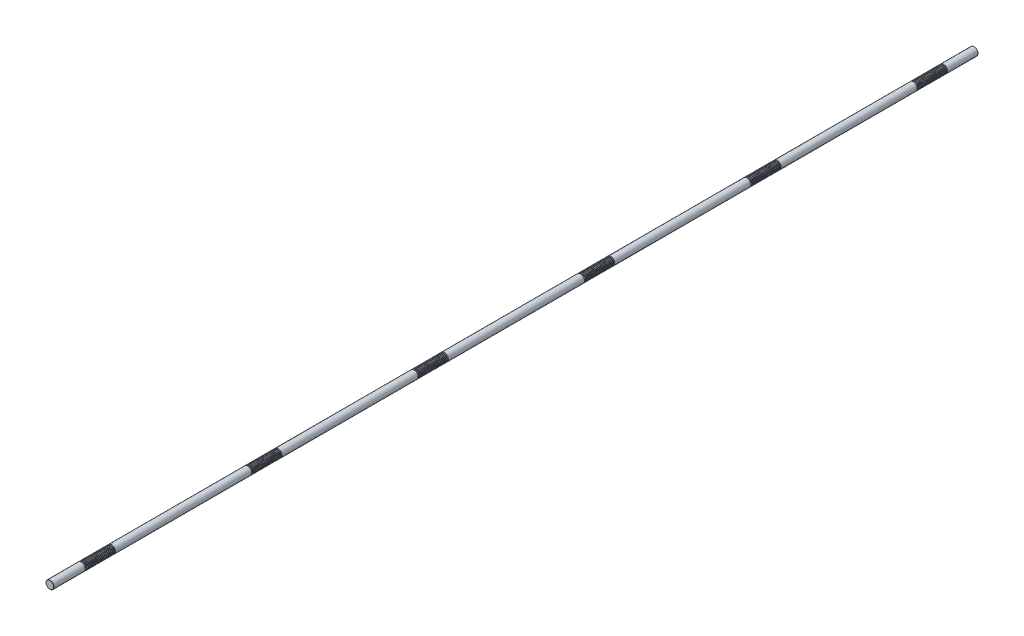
from build123d import *

# Parameters (mm, degrees)
SKETCH1_R           = 13
BOSS_EXTRUDE1_DEPTH = 1500
CHAMFER1_SIZE       = 0.65
LPATTERN1_COUNT     = 20
LPATTERN1_PITCH     = 5
LPATTERN2_COUNT     = 6
LPATTERN2_PITCH     = 540


with BuildPart() as part:
    # Sketch1 → Boss-Extrude1 (new, symmetric)
    with BuildSketch(Plane.XY):
        Circle(SKETCH1_R)
    extrude(amount=BOSS_EXTRUDE1_DEPTH, both=True)

    # Chamfer1
    chamfer1_edges = [part.edges().sort_by_distance(p)[0] for p in [
        (-13, 0, -1500),
        (-13, 0, 1500),
    ]]
    chamfer(chamfer1_edges, length=CHAMFER1_SIZE)

    # Sketch2 → Cut-Revolve1 (revolve, cut)
    with BuildSketch(Plane(origin=(0, 0, 0), x_dir=(0, 0, -1), z_dir=(1, 0, 0)), mode=Mode.PRIVATE) as cut_revolve1_sk:
        Polygon((1400.36843014, 13), (1397.13156986, 13), (1397.86843014, 10.25), (1399.63156986, 10.25), align=None)
    cut_revolve1 = revolve(cut_revolve1_sk.sketch.rotate(Axis((0, 0, 1500), (0, 0, -1)), 90), axis=Axis((0, 0, 1500), (0, 0, -1)), mode=Mode.SUBTRACT)

    # LPattern1: Cut-Revolve1 ×20
    with Locations(*[(0, 0, i * LPATTERN1_PITCH) for i in range(1, LPATTERN1_COUNT)]):
        add(cut_revolve1, mode=Mode.SUBTRACT)

    # LPattern2: Cut-Revolve1 ×6
    with Locations(*[(0, 0, i * LPATTERN2_PITCH) for i in range(1, LPATTERN2_COUNT)]):
        add(cut_revolve1, mode=Mode.SUBTRACT)

    # LPattern2 copy 1 sketch → LPattern2 copy 1 (revolve, cut)
    with BuildSketch(Plane(origin=(0, 0, 545), x_dir=(0, 0, -1), z_dir=(1, 0, 0))):
        Polygon((1400.36843014, 13), (1397.13156986, 13), (1397.86843014, 10.25), (1399.63156986, 10.25), align=None)
    revolve(axis=Axis((0, 0, 2045), (0, 0, -1)), mode=Mode.SUBTRACT)

    # LPattern2 copy 2 sketch → LPattern2 copy 2 (revolve, cut)
    with BuildSketch(Plane(origin=(0, 0, 1085), x_dir=(0, 0, -1), z_dir=(1, 0, 0))):
        Polygon((1400.36843014, 13), (1397.13156986, 13), (1397.86843014, 10.25), (1399.63156986, 10.25), align=None)
    revolve(axis=Axis((0, 0, 2585), (0, 0, -1)), mode=Mode.SUBTRACT)

    # LPattern2 copy 3 sketch → LPattern2 copy 3 (revolve, cut)
    with BuildSketch(Plane(origin=(0, 0, 1625), x_dir=(0, 0, -1), z_dir=(1, 0, 0))):
        Polygon((1400.36843014, 13), (1397.13156986, 13), (1397.86843014, 10.25), (1399.63156986, 10.25), align=None)
    revolve(axis=Axis((0, 0, 3125), (0, 0, -1)), mode=Mode.SUBTRACT)

    # LPattern2 copy 4 sketch → LPattern2 copy 4 (revolve, cut)
    with BuildSketch(Plane(origin=(0, 0, 2165), x_dir=(0, 0, -1), z_dir=(1, 0, 0))):
        Polygon((1400.36843014, 13), (1397.13156986, 13), (1397.86843014, 10.25), (1399.63156986, 10.25), align=None)
    revolve(axis=Axis((0, 0, 3665), (0, 0, -1)), mode=Mode.SUBTRACT)

    # LPattern2 copy 5 sketch → LPattern2 copy 5 (revolve, cut)
    with BuildSketch(Plane(origin=(0, 0, 2705), x_dir=(0, 0, -1), z_dir=(1, 0, 0))):
        Polygon((1400.36843014, 13), (1397.13156986, 13), (1397.86843014, 10.25), (1399.63156986, 10.25), align=None)
    revolve(axis=Axis((0, 0, 4205), (0, 0, -1)), mode=Mode.SUBTRACT)

    # LPattern2 copy 6 sketch → LPattern2 copy 6 (revolve, cut)
    with BuildSketch(Plane(origin=(0, 0, 550), x_dir=(0, 0, -1), z_dir=(1, 0, 0))):
        Polygon((1400.36843014, 13), (1397.13156986, 13), (1397.86843014, 10.25), (1399.63156986, 10.25), align=None)
    revolve(axis=Axis((0, 0, 2050), (0, 0, -1)), mode=Mode.SUBTRACT)

    # LPattern2 copy 7 sketch → LPattern2 copy 7 (revolve, cut)
    with BuildSketch(Plane(origin=(0, 0, 1090), x_dir=(0, 0, -1), z_dir=(1, 0, 0))):
        Polygon((1400.36843014, 13), (1397.13156986, 13), (1397.86843014, 10.25), (1399.63156986, 10.25), align=None)
    revolve(axis=Axis((0, 0, 2590), (0, 0, -1)), mode=Mode.SUBTRACT)

    # LPattern2 copy 8 sketch → LPattern2 copy 8 (revolve, cut)
    with BuildSketch(Plane(origin=(0, 0, 1630), x_dir=(0, 0, -1), z_dir=(1, 0, 0))):
        Polygon((1400.36843014, 13), (1397.13156986, 13), (1397.86843014, 10.25), (1399.63156986, 10.25), align=None)
    revolve(axis=Axis((0, 0, 3130), (0, 0, -1)), mode=Mode.SUBTRACT)

    # LPattern2 copy 9 sketch → LPattern2 copy 9 (revolve, cut)
    with BuildSketch(Plane(origin=(0, 0, 2170), x_dir=(0, 0, -1), z_dir=(1, 0, 0))):
        Polygon((1400.36843014, 13), (1397.13156986, 13), (1397.86843014, 10.25), (1399.63156986, 10.25), align=None)
    revolve(axis=Axis((0, 0, 3670), (0, 0, -1)), mode=Mode.SUBTRACT)

    # LPattern2 copy 10 sketch → LPattern2 copy 10 (revolve, cut)
    with BuildSketch(Plane(origin=(0, 0, 2710), x_dir=(0, 0, -1), z_dir=(1, 0, 0))):
        Polygon((1400.36843014, 13), (1397.13156986, 13), (1397.86843014, 10.25), (1399.63156986, 10.25), align=None)
    revolve(axis=Axis((0, 0, 4210), (0, 0, -1)), mode=Mode.SUBTRACT)

    # LPattern2 copy 11 sketch → LPattern2 copy 11 (revolve, cut)
    with BuildSketch(Plane(origin=(0, 0, 555), x_dir=(0, 0, -1), z_dir=(1, 0, 0))):
        Polygon((1400.36843014, 13), (1397.13156986, 13), (1397.86843014, 10.25), (1399.63156986, 10.25), align=None)
    revolve(axis=Axis((0, 0, 2055), (0, 0, -1)), mode=Mode.SUBTRACT)

    # LPattern2 copy 12 sketch → LPattern2 copy 12 (revolve, cut)
    with BuildSketch(Plane(origin=(0, 0, 1095), x_dir=(0, 0, -1), z_dir=(1, 0, 0))):
        Polygon((1400.36843014, 13), (1397.13156986, 13), (1397.86843014, 10.25), (1399.63156986, 10.25), align=None)
    revolve(axis=Axis((0, 0, 2595), (0, 0, -1)), mode=Mode.SUBTRACT)

    # LPattern2 copy 13 sketch → LPattern2 copy 13 (revolve, cut)
    with BuildSketch(Plane(origin=(0, 0, 1635), x_dir=(0, 0, -1), z_dir=(1, 0, 0))):
        Polygon((1400.36843014, 13), (1397.13156986, 13), (1397.86843014, 10.25), (1399.63156986, 10.25), align=None)
    revolve(axis=Axis((0, 0, 3135), (0, 0, -1)), mode=Mode.SUBTRACT)

    # LPattern2 copy 14 sketch → LPattern2 copy 14 (revolve, cut)
    with BuildSketch(Plane(origin=(0, 0, 2175), x_dir=(0, 0, -1), z_dir=(1, 0, 0))):
        Polygon((1400.36843014, 13), (1397.13156986, 13), (1397.86843014, 10.25), (1399.63156986, 10.25), align=None)
    revolve(axis=Axis((0, 0, 3675), (0, 0, -1)), mode=Mode.SUBTRACT)

    # LPattern2 copy 15 sketch → LPattern2 copy 15 (revolve, cut)
    with BuildSketch(Plane(origin=(0, 0, 2715), x_dir=(0, 0, -1), z_dir=(1, 0, 0))):
        Polygon((1400.36843014, 13), (1397.13156986, 13), (1397.86843014, 10.25), (1399.63156986, 10.25), align=None)
    revolve(axis=Axis((0, 0, 4215), (0, 0, -1)), mode=Mode.SUBTRACT)

    # LPattern2 copy 16 sketch → LPattern2 copy 16 (revolve, cut)
    with BuildSketch(Plane(origin=(0, 0, 560), x_dir=(0, 0, -1), z_dir=(1, 0, 0))):
        Polygon((1400.36843014, 13), (1397.13156986, 13), (1397.86843014, 10.25), (1399.63156986, 10.25), align=None)
    revolve(axis=Axis((0, 0, 2060), (0, 0, -1)), mode=Mode.SUBTRACT)

    # LPattern2 copy 17 sketch → LPattern2 copy 17 (revolve, cut)
    with BuildSketch(Plane(origin=(0, 0, 1100), x_dir=(0, 0, -1), z_dir=(1, 0, 0))):
        Polygon((1400.36843014, 13), (1397.13156986, 13), (1397.86843014, 10.25), (1399.63156986, 10.25), align=None)
    revolve(axis=Axis((0, 0, 2600), (0, 0, -1)), mode=Mode.SUBTRACT)

    # LPattern2 copy 18 sketch → LPattern2 copy 18 (revolve, cut)
    with BuildSketch(Plane(origin=(0, 0, 1640), x_dir=(0, 0, -1), z_dir=(1, 0, 0))):
        Polygon((1400.36843014, 13), (1397.13156986, 13), (1397.86843014, 10.25), (1399.63156986, 10.25), align=None)
    revolve(axis=Axis((0, 0, 3140), (0, 0, -1)), mode=Mode.SUBTRACT)

    # LPattern2 copy 19 sketch → LPattern2 copy 19 (revolve, cut)
    with BuildSketch(Plane(origin=(0, 0, 2180), x_dir=(0, 0, -1), z_dir=(1, 0, 0))):
        Polygon((1400.36843014, 13), (1397.13156986, 13), (1397.86843014, 10.25), (1399.63156986, 10.25), align=None)
    revolve(axis=Axis((0, 0, 3680), (0, 0, -1)), mode=Mode.SUBTRACT)

    # LPattern2 copy 20 sketch → LPattern2 copy 20 (revolve, cut)
    with BuildSketch(Plane(origin=(0, 0, 2720), x_dir=(0, 0, -1), z_dir=(1, 0, 0))):
        Polygon((1400.36843014, 13), (1397.13156986, 13), (1397.86843014, 10.25), (1399.63156986, 10.25), align=None)
    revolve(axis=Axis((0, 0, 4220), (0, 0, -1)), mode=Mode.SUBTRACT)

    # LPattern2 copy 21 sketch → LPattern2 copy 21 (revolve, cut)
    with BuildSketch(Plane(origin=(0, 0, 565), x_dir=(0, 0, -1), z_dir=(1, 0, 0))):
        Polygon((1400.36843014, 13), (1397.13156986, 13), (1397.86843014, 10.25), (1399.63156986, 10.25), align=None)
    revolve(axis=Axis((0, 0, 2065), (0, 0, -1)), mode=Mode.SUBTRACT)

    # LPattern2 copy 22 sketch → LPattern2 copy 22 (revolve, cut)
    with BuildSketch(Plane(origin=(0, 0, 1105), x_dir=(0, 0, -1), z_dir=(1, 0, 0))):
        Polygon((1400.36843014, 13), (1397.13156986, 13), (1397.86843014, 10.25), (1399.63156986, 10.25), align=None)
    revolve(axis=Axis((0, 0, 2605), (0, 0, -1)), mode=Mode.SUBTRACT)

    # LPattern2 copy 23 sketch → LPattern2 copy 23 (revolve, cut)
    with BuildSketch(Plane(origin=(0, 0, 1645), x_dir=(0, 0, -1), z_dir=(1, 0, 0))):
        Polygon((1400.36843014, 13), (1397.13156986, 13), (1397.86843014, 10.25), (1399.63156986, 10.25), align=None)
    revolve(axis=Axis((0, 0, 3145), (0, 0, -1)), mode=Mode.SUBTRACT)

    # LPattern2 copy 24 sketch → LPattern2 copy 24 (revolve, cut)
    with BuildSketch(Plane(origin=(0, 0, 2185), x_dir=(0, 0, -1), z_dir=(1, 0, 0))):
        Polygon((1400.36843014, 13), (1397.13156986, 13), (1397.86843014, 10.25), (1399.63156986, 10.25), align=None)
    revolve(axis=Axis((0, 0, 3685), (0, 0, -1)), mode=Mode.SUBTRACT)

    # LPattern2 copy 25 sketch → LPattern2 copy 25 (revolve, cut)
    with BuildSketch(Plane(origin=(0, 0, 2725), x_dir=(0, 0, -1), z_dir=(1, 0, 0))):
        Polygon((1400.36843014, 13), (1397.13156986, 13), (1397.86843014, 10.25), (1399.63156986, 10.25), align=None)
    revolve(axis=Axis((0, 0, 4225), (0, 0, -1)), mode=Mode.SUBTRACT)

    # LPattern2 copy 26 sketch → LPattern2 copy 26 (revolve, cut)
    with BuildSketch(Plane(origin=(0, 0, 570), x_dir=(0, 0, -1), z_dir=(1, 0, 0))):
        Polygon((1400.36843014, 13), (1397.13156986, 13), (1397.86843014, 10.25), (1399.63156986, 10.25), align=None)
    revolve(axis=Axis((0, 0, 2070), (0, 0, -1)), mode=Mode.SUBTRACT)

    # LPattern2 copy 27 sketch → LPattern2 copy 27 (revolve, cut)
    with BuildSketch(Plane(origin=(0, 0, 1110), x_dir=(0, 0, -1), z_dir=(1, 0, 0))):
        Polygon((1400.36843014, 13), (1397.13156986, 13), (1397.86843014, 10.25), (1399.63156986, 10.25), align=None)
    revolve(axis=Axis((0, 0, 2610), (0, 0, -1)), mode=Mode.SUBTRACT)

    # LPattern2 copy 28 sketch → LPattern2 copy 28 (revolve, cut)
    with BuildSketch(Plane(origin=(0, 0, 1650), x_dir=(0, 0, -1), z_dir=(1, 0, 0))):
        Polygon((1400.36843014, 13), (1397.13156986, 13), (1397.86843014, 10.25), (1399.63156986, 10.25), align=None)
    revolve(axis=Axis((0, 0, 3150), (0, 0, -1)), mode=Mode.SUBTRACT)

    # LPattern2 copy 29 sketch → LPattern2 copy 29 (revolve, cut)
    with BuildSketch(Plane(origin=(0, 0, 2190), x_dir=(0, 0, -1), z_dir=(1, 0, 0))):
        Polygon((1400.36843014, 13), (1397.13156986, 13), (1397.86843014, 10.25), (1399.63156986, 10.25), align=None)
    revolve(axis=Axis((0, 0, 3690), (0, 0, -1)), mode=Mode.SUBTRACT)

    # LPattern2 copy 30 sketch → LPattern2 copy 30 (revolve, cut)
    with BuildSketch(Plane(origin=(0, 0, 2730), x_dir=(0, 0, -1), z_dir=(1, 0, 0))):
        Polygon((1400.36843014, 13), (1397.13156986, 13), (1397.86843014, 10.25), (1399.63156986, 10.25), align=None)
    revolve(axis=Axis((0, 0, 4230), (0, 0, -1)), mode=Mode.SUBTRACT)

    # LPattern2 copy 31 sketch → LPattern2 copy 31 (revolve, cut)
    with BuildSketch(Plane(origin=(0, 0, 575), x_dir=(0, 0, -1), z_dir=(1, 0, 0))):
        Polygon((1400.36843014, 13), (1397.13156986, 13), (1397.86843014, 10.25), (1399.63156986, 10.25), align=None)
    revolve(axis=Axis((0, 0, 2075), (0, 0, -1)), mode=Mode.SUBTRACT)

    # LPattern2 copy 32 sketch → LPattern2 copy 32 (revolve, cut)
    with BuildSketch(Plane(origin=(0, 0, 1115), x_dir=(0, 0, -1), z_dir=(1, 0, 0))):
        Polygon((1400.36843014, 13), (1397.13156986, 13), (1397.86843014, 10.25), (1399.63156986, 10.25), align=None)
    revolve(axis=Axis((0, 0, 2615), (0, 0, -1)), mode=Mode.SUBTRACT)

    # LPattern2 copy 33 sketch → LPattern2 copy 33 (revolve, cut)
    with BuildSketch(Plane(origin=(0, 0, 1655), x_dir=(0, 0, -1), z_dir=(1, 0, 0))):
        Polygon((1400.36843014, 13), (1397.13156986, 13), (1397.86843014, 10.25), (1399.63156986, 10.25), align=None)
    revolve(axis=Axis((0, 0, 3155), (0, 0, -1)), mode=Mode.SUBTRACT)

    # LPattern2 copy 34 sketch → LPattern2 copy 34 (revolve, cut)
    with BuildSketch(Plane(origin=(0, 0, 2195), x_dir=(0, 0, -1), z_dir=(1, 0, 0))):
        Polygon((1400.36843014, 13), (1397.13156986, 13), (1397.86843014, 10.25), (1399.63156986, 10.25), align=None)
    revolve(axis=Axis((0, 0, 3695), (0, 0, -1)), mode=Mode.SUBTRACT)

    # LPattern2 copy 35 sketch → LPattern2 copy 35 (revolve, cut)
    with BuildSketch(Plane(origin=(0, 0, 2735), x_dir=(0, 0, -1), z_dir=(1, 0, 0))):
        Polygon((1400.36843014, 13), (1397.13156986, 13), (1397.86843014, 10.25), (1399.63156986, 10.25), align=None)
    revolve(axis=Axis((0, 0, 4235), (0, 0, -1)), mode=Mode.SUBTRACT)

    # LPattern2 copy 36 sketch → LPattern2 copy 36 (revolve, cut)
    with BuildSketch(Plane(origin=(0, 0, 580), x_dir=(0, 0, -1), z_dir=(1, 0, 0))):
        Polygon((1400.36843014, 13), (1397.13156986, 13), (1397.86843014, 10.25), (1399.63156986, 10.25), align=None)
    revolve(axis=Axis((0, 0, 2080), (0, 0, -1)), mode=Mode.SUBTRACT)

    # LPattern2 copy 37 sketch → LPattern2 copy 37 (revolve, cut)
    with BuildSketch(Plane(origin=(0, 0, 1120), x_dir=(0, 0, -1), z_dir=(1, 0, 0))):
        Polygon((1400.36843014, 13), (1397.13156986, 13), (1397.86843014, 10.25), (1399.63156986, 10.25), align=None)
    revolve(axis=Axis((0, 0, 2620), (0, 0, -1)), mode=Mode.SUBTRACT)

    # LPattern2 copy 38 sketch → LPattern2 copy 38 (revolve, cut)
    with BuildSketch(Plane(origin=(0, 0, 1660), x_dir=(0, 0, -1), z_dir=(1, 0, 0))):
        Polygon((1400.36843014, 13), (1397.13156986, 13), (1397.86843014, 10.25), (1399.63156986, 10.25), align=None)
    revolve(axis=Axis((0, 0, 3160), (0, 0, -1)), mode=Mode.SUBTRACT)

    # LPattern2 copy 39 sketch → LPattern2 copy 39 (revolve, cut)
    with BuildSketch(Plane(origin=(0, 0, 2200), x_dir=(0, 0, -1), z_dir=(1, 0, 0))):
        Polygon((1400.36843014, 13), (1397.13156986, 13), (1397.86843014, 10.25), (1399.63156986, 10.25), align=None)
    revolve(axis=Axis((0, 0, 3700), (0, 0, -1)), mode=Mode.SUBTRACT)

    # LPattern2 copy 40 sketch → LPattern2 copy 40 (revolve, cut)
    with BuildSketch(Plane(origin=(0, 0, 2740), x_dir=(0, 0, -1), z_dir=(1, 0, 0))):
        Polygon((1400.36843014, 13), (1397.13156986, 13), (1397.86843014, 10.25), (1399.63156986, 10.25), align=None)
    revolve(axis=Axis((0, 0, 4240), (0, 0, -1)), mode=Mode.SUBTRACT)

    # LPattern2 copy 41 sketch → LPattern2 copy 41 (revolve, cut)
    with BuildSketch(Plane(origin=(0, 0, 585), x_dir=(0, 0, -1), z_dir=(1, 0, 0))):
        Polygon((1400.36843014, 13), (1397.13156986, 13), (1397.86843014, 10.25), (1399.63156986, 10.25), align=None)
    revolve(axis=Axis((0, 0, 2085), (0, 0, -1)), mode=Mode.SUBTRACT)

    # LPattern2 copy 42 sketch → LPattern2 copy 42 (revolve, cut)
    with BuildSketch(Plane(origin=(0, 0, 1125), x_dir=(0, 0, -1), z_dir=(1, 0, 0))):
        Polygon((1400.36843014, 13), (1397.13156986, 13), (1397.86843014, 10.25), (1399.63156986, 10.25), align=None)
    revolve(axis=Axis((0, 0, 2625), (0, 0, -1)), mode=Mode.SUBTRACT)

    # LPattern2 copy 43 sketch → LPattern2 copy 43 (revolve, cut)
    with BuildSketch(Plane(origin=(0, 0, 1665), x_dir=(0, 0, -1), z_dir=(1, 0, 0))):
        Polygon((1400.36843014, 13), (1397.13156986, 13), (1397.86843014, 10.25), (1399.63156986, 10.25), align=None)
    revolve(axis=Axis((0, 0, 3165), (0, 0, -1)), mode=Mode.SUBTRACT)

    # LPattern2 copy 44 sketch → LPattern2 copy 44 (revolve, cut)
    with BuildSketch(Plane(origin=(0, 0, 2205), x_dir=(0, 0, -1), z_dir=(1, 0, 0))):
        Polygon((1400.36843014, 13), (1397.13156986, 13), (1397.86843014, 10.25), (1399.63156986, 10.25), align=None)
    revolve(axis=Axis((0, 0, 3705), (0, 0, -1)), mode=Mode.SUBTRACT)

    # LPattern2 copy 45 sketch → LPattern2 copy 45 (revolve, cut)
    with BuildSketch(Plane(origin=(0, 0, 2745), x_dir=(0, 0, -1), z_dir=(1, 0, 0))):
        Polygon((1400.36843014, 13), (1397.13156986, 13), (1397.86843014, 10.25), (1399.63156986, 10.25), align=None)
    revolve(axis=Axis((0, 0, 4245), (0, 0, -1)), mode=Mode.SUBTRACT)

    # LPattern2 copy 46 sketch → LPattern2 copy 46 (revolve, cut)
    with BuildSketch(Plane(origin=(0, 0, 590), x_dir=(0, 0, -1), z_dir=(1, 0, 0))):
        Polygon((1400.36843014, 13), (1397.13156986, 13), (1397.86843014, 10.25), (1399.63156986, 10.25), align=None)
    revolve(axis=Axis((0, 0, 2090), (0, 0, -1)), mode=Mode.SUBTRACT)

    # LPattern2 copy 47 sketch → LPattern2 copy 47 (revolve, cut)
    with BuildSketch(Plane(origin=(0, 0, 1130), x_dir=(0, 0, -1), z_dir=(1, 0, 0))):
        Polygon((1400.36843014, 13), (1397.13156986, 13), (1397.86843014, 10.25), (1399.63156986, 10.25), align=None)
    revolve(axis=Axis((0, 0, 2630), (0, 0, -1)), mode=Mode.SUBTRACT)

    # LPattern2 copy 48 sketch → LPattern2 copy 48 (revolve, cut)
    with BuildSketch(Plane(origin=(0, 0, 1670), x_dir=(0, 0, -1), z_dir=(1, 0, 0))):
        Polygon((1400.36843014, 13), (1397.13156986, 13), (1397.86843014, 10.25), (1399.63156986, 10.25), align=None)
    revolve(axis=Axis((0, 0, 3170), (0, 0, -1)), mode=Mode.SUBTRACT)

    # LPattern2 copy 49 sketch → LPattern2 copy 49 (revolve, cut)
    with BuildSketch(Plane(origin=(0, 0, 2210), x_dir=(0, 0, -1), z_dir=(1, 0, 0))):
        Polygon((1400.36843014, 13), (1397.13156986, 13), (1397.86843014, 10.25), (1399.63156986, 10.25), align=None)
    revolve(axis=Axis((0, 0, 3710), (0, 0, -1)), mode=Mode.SUBTRACT)

    # LPattern2 copy 50 sketch → LPattern2 copy 50 (revolve, cut)
    with BuildSketch(Plane(origin=(0, 0, 2750), x_dir=(0, 0, -1), z_dir=(1, 0, 0))):
        Polygon((1400.36843014, 13), (1397.13156986, 13), (1397.86843014, 10.25), (1399.63156986, 10.25), align=None)
    revolve(axis=Axis((0, 0, 4250), (0, 0, -1)), mode=Mode.SUBTRACT)

    # LPattern2 copy 51 sketch → LPattern2 copy 51 (revolve, cut)
    with BuildSketch(Plane(origin=(0, 0, 595), x_dir=(0, 0, -1), z_dir=(1, 0, 0))):
        Polygon((1400.36843014, 13), (1397.13156986, 13), (1397.86843014, 10.25), (1399.63156986, 10.25), align=None)
    revolve(axis=Axis((0, 0, 2095), (0, 0, -1)), mode=Mode.SUBTRACT)

    # LPattern2 copy 52 sketch → LPattern2 copy 52 (revolve, cut)
    with BuildSketch(Plane(origin=(0, 0, 1135), x_dir=(0, 0, -1), z_dir=(1, 0, 0))):
        Polygon((1400.36843014, 13), (1397.13156986, 13), (1397.86843014, 10.25), (1399.63156986, 10.25), align=None)
    revolve(axis=Axis((0, 0, 2635), (0, 0, -1)), mode=Mode.SUBTRACT)

    # LPattern2 copy 53 sketch → LPattern2 copy 53 (revolve, cut)
    with BuildSketch(Plane(origin=(0, 0, 1675), x_dir=(0, 0, -1), z_dir=(1, 0, 0))):
        Polygon((1400.36843014, 13), (1397.13156986, 13), (1397.86843014, 10.25), (1399.63156986, 10.25), align=None)
    revolve(axis=Axis((0, 0, 3175), (0, 0, -1)), mode=Mode.SUBTRACT)

    # LPattern2 copy 54 sketch → LPattern2 copy 54 (revolve, cut)
    with BuildSketch(Plane(origin=(0, 0, 2215), x_dir=(0, 0, -1), z_dir=(1, 0, 0))):
        Polygon((1400.36843014, 13), (1397.13156986, 13), (1397.86843014, 10.25), (1399.63156986, 10.25), align=None)
    revolve(axis=Axis((0, 0, 3715), (0, 0, -1)), mode=Mode.SUBTRACT)

    # LPattern2 copy 55 sketch → LPattern2 copy 55 (revolve, cut)
    with BuildSketch(Plane(origin=(0, 0, 2755), x_dir=(0, 0, -1), z_dir=(1, 0, 0))):
        Polygon((1400.36843014, 13), (1397.13156986, 13), (1397.86843014, 10.25), (1399.63156986, 10.25), align=None)
    revolve(axis=Axis((0, 0, 4255), (0, 0, -1)), mode=Mode.SUBTRACT)

    # LPattern2 copy 56 sketch → LPattern2 copy 56 (revolve, cut)
    with BuildSketch(Plane(origin=(0, 0, 600), x_dir=(0, 0, -1), z_dir=(1, 0, 0))):
        Polygon((1400.36843014, 13), (1397.13156986, 13), (1397.86843014, 10.25), (1399.63156986, 10.25), align=None)
    revolve(axis=Axis((0, 0, 2100), (0, 0, -1)), mode=Mode.SUBTRACT)

    # LPattern2 copy 57 sketch → LPattern2 copy 57 (revolve, cut)
    with BuildSketch(Plane(origin=(0, 0, 1140), x_dir=(0, 0, -1), z_dir=(1, 0, 0))):
        Polygon((1400.36843014, 13), (1397.13156986, 13), (1397.86843014, 10.25), (1399.63156986, 10.25), align=None)
    revolve(axis=Axis((0, 0, 2640), (0, 0, -1)), mode=Mode.SUBTRACT)

    # LPattern2 copy 58 sketch → LPattern2 copy 58 (revolve, cut)
    with BuildSketch(Plane(origin=(0, 0, 1680), x_dir=(0, 0, -1), z_dir=(1, 0, 0))):
        Polygon((1400.36843014, 13), (1397.13156986, 13), (1397.86843014, 10.25), (1399.63156986, 10.25), align=None)
    revolve(axis=Axis((0, 0, 3180), (0, 0, -1)), mode=Mode.SUBTRACT)

    # LPattern2 copy 59 sketch → LPattern2 copy 59 (revolve, cut)
    with BuildSketch(Plane(origin=(0, 0, 2220), x_dir=(0, 0, -1), z_dir=(1, 0, 0))):
        Polygon((1400.36843014, 13), (1397.13156986, 13), (1397.86843014, 10.25), (1399.63156986, 10.25), align=None)
    revolve(axis=Axis((0, 0, 3720), (0, 0, -1)), mode=Mode.SUBTRACT)

    # LPattern2 copy 60 sketch → LPattern2 copy 60 (revolve, cut)
    with BuildSketch(Plane(origin=(0, 0, 2760), x_dir=(0, 0, -1), z_dir=(1, 0, 0))):
        Polygon((1400.36843014, 13), (1397.13156986, 13), (1397.86843014, 10.25), (1399.63156986, 10.25), align=None)
    revolve(axis=Axis((0, 0, 4260), (0, 0, -1)), mode=Mode.SUBTRACT)

    # LPattern2 copy 61 sketch → LPattern2 copy 61 (revolve, cut)
    with BuildSketch(Plane(origin=(0, 0, 605), x_dir=(0, 0, -1), z_dir=(1, 0, 0))):
        Polygon((1400.36843014, 13), (1397.13156986, 13), (1397.86843014, 10.25), (1399.63156986, 10.25), align=None)
    revolve(axis=Axis((0, 0, 2105), (0, 0, -1)), mode=Mode.SUBTRACT)

    # LPattern2 copy 62 sketch → LPattern2 copy 62 (revolve, cut)
    with BuildSketch(Plane(origin=(0, 0, 1145), x_dir=(0, 0, -1), z_dir=(1, 0, 0))):
        Polygon((1400.36843014, 13), (1397.13156986, 13), (1397.86843014, 10.25), (1399.63156986, 10.25), align=None)
    revolve(axis=Axis((0, 0, 2645), (0, 0, -1)), mode=Mode.SUBTRACT)

    # LPattern2 copy 63 sketch → LPattern2 copy 63 (revolve, cut)
    with BuildSketch(Plane(origin=(0, 0, 1685), x_dir=(0, 0, -1), z_dir=(1, 0, 0))):
        Polygon((1400.36843014, 13), (1397.13156986, 13), (1397.86843014, 10.25), (1399.63156986, 10.25), align=None)
    revolve(axis=Axis((0, 0, 3185), (0, 0, -1)), mode=Mode.SUBTRACT)

    # LPattern2 copy 64 sketch → LPattern2 copy 64 (revolve, cut)
    with BuildSketch(Plane(origin=(0, 0, 2225), x_dir=(0, 0, -1), z_dir=(1, 0, 0))):
        Polygon((1400.36843014, 13), (1397.13156986, 13), (1397.86843014, 10.25), (1399.63156986, 10.25), align=None)
    revolve(axis=Axis((0, 0, 3725), (0, 0, -1)), mode=Mode.SUBTRACT)

    # LPattern2 copy 65 sketch → LPattern2 copy 65 (revolve, cut)
    with BuildSketch(Plane(origin=(0, 0, 2765), x_dir=(0, 0, -1), z_dir=(1, 0, 0))):
        Polygon((1400.36843014, 13), (1397.13156986, 13), (1397.86843014, 10.25), (1399.63156986, 10.25), align=None)
    revolve(axis=Axis((0, 0, 4265), (0, 0, -1)), mode=Mode.SUBTRACT)

    # LPattern2 copy 66 sketch → LPattern2 copy 66 (revolve, cut)
    with BuildSketch(Plane(origin=(0, 0, 610), x_dir=(0, 0, -1), z_dir=(1, 0, 0))):
        Polygon((1400.36843014, 13), (1397.13156986, 13), (1397.86843014, 10.25), (1399.63156986, 10.25), align=None)
    revolve(axis=Axis((0, 0, 2110), (0, 0, -1)), mode=Mode.SUBTRACT)

    # LPattern2 copy 67 sketch → LPattern2 copy 67 (revolve, cut)
    with BuildSketch(Plane(origin=(0, 0, 1150), x_dir=(0, 0, -1), z_dir=(1, 0, 0))):
        Polygon((1400.36843014, 13), (1397.13156986, 13), (1397.86843014, 10.25), (1399.63156986, 10.25), align=None)
    revolve(axis=Axis((0, 0, 2650), (0, 0, -1)), mode=Mode.SUBTRACT)

    # LPattern2 copy 68 sketch → LPattern2 copy 68 (revolve, cut)
    with BuildSketch(Plane(origin=(0, 0, 1690), x_dir=(0, 0, -1), z_dir=(1, 0, 0))):
        Polygon((1400.36843014, 13), (1397.13156986, 13), (1397.86843014, 10.25), (1399.63156986, 10.25), align=None)
    revolve(axis=Axis((0, 0, 3190), (0, 0, -1)), mode=Mode.SUBTRACT)

    # LPattern2 copy 69 sketch → LPattern2 copy 69 (revolve, cut)
    with BuildSketch(Plane(origin=(0, 0, 2230), x_dir=(0, 0, -1), z_dir=(1, 0, 0))):
        Polygon((1400.36843014, 13), (1397.13156986, 13), (1397.86843014, 10.25), (1399.63156986, 10.25), align=None)
    revolve(axis=Axis((0, 0, 3730), (0, 0, -1)), mode=Mode.SUBTRACT)

    # LPattern2 copy 70 sketch → LPattern2 copy 70 (revolve, cut)
    with BuildSketch(Plane(origin=(0, 0, 2770), x_dir=(0, 0, -1), z_dir=(1, 0, 0))):
        Polygon((1400.36843014, 13), (1397.13156986, 13), (1397.86843014, 10.25), (1399.63156986, 10.25), align=None)
    revolve(axis=Axis((0, 0, 4270), (0, 0, -1)), mode=Mode.SUBTRACT)

    # LPattern2 copy 71 sketch → LPattern2 copy 71 (revolve, cut)
    with BuildSketch(Plane(origin=(0, 0, 615), x_dir=(0, 0, -1), z_dir=(1, 0, 0))):
        Polygon((1400.36843014, 13), (1397.13156986, 13), (1397.86843014, 10.25), (1399.63156986, 10.25), align=None)
    revolve(axis=Axis((0, 0, 2115), (0, 0, -1)), mode=Mode.SUBTRACT)

    # LPattern2 copy 72 sketch → LPattern2 copy 72 (revolve, cut)
    with BuildSketch(Plane(origin=(0, 0, 1155), x_dir=(0, 0, -1), z_dir=(1, 0, 0))):
        Polygon((1400.36843014, 13), (1397.13156986, 13), (1397.86843014, 10.25), (1399.63156986, 10.25), align=None)
    revolve(axis=Axis((0, 0, 2655), (0, 0, -1)), mode=Mode.SUBTRACT)

    # LPattern2 copy 73 sketch → LPattern2 copy 73 (revolve, cut)
    with BuildSketch(Plane(origin=(0, 0, 1695), x_dir=(0, 0, -1), z_dir=(1, 0, 0))):
        Polygon((1400.36843014, 13), (1397.13156986, 13), (1397.86843014, 10.25), (1399.63156986, 10.25), align=None)
    revolve(axis=Axis((0, 0, 3195), (0, 0, -1)), mode=Mode.SUBTRACT)

    # LPattern2 copy 74 sketch → LPattern2 copy 74 (revolve, cut)
    with BuildSketch(Plane(origin=(0, 0, 2235), x_dir=(0, 0, -1), z_dir=(1, 0, 0))):
        Polygon((1400.36843014, 13), (1397.13156986, 13), (1397.86843014, 10.25), (1399.63156986, 10.25), align=None)
    revolve(axis=Axis((0, 0, 3735), (0, 0, -1)), mode=Mode.SUBTRACT)

    # LPattern2 copy 75 sketch → LPattern2 copy 75 (revolve, cut)
    with BuildSketch(Plane(origin=(0, 0, 2775), x_dir=(0, 0, -1), z_dir=(1, 0, 0))):
        Polygon((1400.36843014, 13), (1397.13156986, 13), (1397.86843014, 10.25), (1399.63156986, 10.25), align=None)
    revolve(axis=Axis((0, 0, 4275), (0, 0, -1)), mode=Mode.SUBTRACT)

    # LPattern2 copy 76 sketch → LPattern2 copy 76 (revolve, cut)
    with BuildSketch(Plane(origin=(0, 0, 620), x_dir=(0, 0, -1), z_dir=(1, 0, 0))):
        Polygon((1400.36843014, 13), (1397.13156986, 13), (1397.86843014, 10.25), (1399.63156986, 10.25), align=None)
    revolve(axis=Axis((0, 0, 2120), (0, 0, -1)), mode=Mode.SUBTRACT)

    # LPattern2 copy 77 sketch → LPattern2 copy 77 (revolve, cut)
    with BuildSketch(Plane(origin=(0, 0, 1160), x_dir=(0, 0, -1), z_dir=(1, 0, 0))):
        Polygon((1400.36843014, 13), (1397.13156986, 13), (1397.86843014, 10.25), (1399.63156986, 10.25), align=None)
    revolve(axis=Axis((0, 0, 2660), (0, 0, -1)), mode=Mode.SUBTRACT)

    # LPattern2 copy 78 sketch → LPattern2 copy 78 (revolve, cut)
    with BuildSketch(Plane(origin=(0, 0, 1700), x_dir=(0, 0, -1), z_dir=(1, 0, 0))):
        Polygon((1400.36843014, 13), (1397.13156986, 13), (1397.86843014, 10.25), (1399.63156986, 10.25), align=None)
    revolve(axis=Axis((0, 0, 3200), (0, 0, -1)), mode=Mode.SUBTRACT)

    # LPattern2 copy 79 sketch → LPattern2 copy 79 (revolve, cut)
    with BuildSketch(Plane(origin=(0, 0, 2240), x_dir=(0, 0, -1), z_dir=(1, 0, 0))):
        Polygon((1400.36843014, 13), (1397.13156986, 13), (1397.86843014, 10.25), (1399.63156986, 10.25), align=None)
    revolve(axis=Axis((0, 0, 3740), (0, 0, -1)), mode=Mode.SUBTRACT)

    # LPattern2 copy 80 sketch → LPattern2 copy 80 (revolve, cut)
    with BuildSketch(Plane(origin=(0, 0, 2780), x_dir=(0, 0, -1), z_dir=(1, 0, 0))):
        Polygon((1400.36843014, 13), (1397.13156986, 13), (1397.86843014, 10.25), (1399.63156986, 10.25), align=None)
    revolve(axis=Axis((0, 0, 4280), (0, 0, -1)), mode=Mode.SUBTRACT)

    # LPattern2 copy 81 sketch → LPattern2 copy 81 (revolve, cut)
    with BuildSketch(Plane(origin=(0, 0, 625), x_dir=(0, 0, -1), z_dir=(1, 0, 0))):
        Polygon((1400.36843014, 13), (1397.13156986, 13), (1397.86843014, 10.25), (1399.63156986, 10.25), align=None)
    revolve(axis=Axis((0, 0, 2125), (0, 0, -1)), mode=Mode.SUBTRACT)

    # LPattern2 copy 82 sketch → LPattern2 copy 82 (revolve, cut)
    with BuildSketch(Plane(origin=(0, 0, 1165), x_dir=(0, 0, -1), z_dir=(1, 0, 0))):
        Polygon((1400.36843014, 13), (1397.13156986, 13), (1397.86843014, 10.25), (1399.63156986, 10.25), align=None)
    revolve(axis=Axis((0, 0, 2665), (0, 0, -1)), mode=Mode.SUBTRACT)

    # LPattern2 copy 83 sketch → LPattern2 copy 83 (revolve, cut)
    with BuildSketch(Plane(origin=(0, 0, 1705), x_dir=(0, 0, -1), z_dir=(1, 0, 0))):
        Polygon((1400.36843014, 13), (1397.13156986, 13), (1397.86843014, 10.25), (1399.63156986, 10.25), align=None)
    revolve(axis=Axis((0, 0, 3205), (0, 0, -1)), mode=Mode.SUBTRACT)

    # LPattern2 copy 84 sketch → LPattern2 copy 84 (revolve, cut)
    with BuildSketch(Plane(origin=(0, 0, 2245), x_dir=(0, 0, -1), z_dir=(1, 0, 0))):
        Polygon((1400.36843014, 13), (1397.13156986, 13), (1397.86843014, 10.25), (1399.63156986, 10.25), align=None)
    revolve(axis=Axis((0, 0, 3745), (0, 0, -1)), mode=Mode.SUBTRACT)

    # LPattern2 copy 85 sketch → LPattern2 copy 85 (revolve, cut)
    with BuildSketch(Plane(origin=(0, 0, 2785), x_dir=(0, 0, -1), z_dir=(1, 0, 0))):
        Polygon((1400.36843014, 13), (1397.13156986, 13), (1397.86843014, 10.25), (1399.63156986, 10.25), align=None)
    revolve(axis=Axis((0, 0, 4285), (0, 0, -1)), mode=Mode.SUBTRACT)

    # LPattern2 copy 86 sketch → LPattern2 copy 86 (revolve, cut)
    with BuildSketch(Plane(origin=(0, 0, 630), x_dir=(0, 0, -1), z_dir=(1, 0, 0))):
        Polygon((1400.36843014, 13), (1397.13156986, 13), (1397.86843014, 10.25), (1399.63156986, 10.25), align=None)
    revolve(axis=Axis((0, 0, 2130), (0, 0, -1)), mode=Mode.SUBTRACT)

    # LPattern2 copy 87 sketch → LPattern2 copy 87 (revolve, cut)
    with BuildSketch(Plane(origin=(0, 0, 1170), x_dir=(0, 0, -1), z_dir=(1, 0, 0))):
        Polygon((1400.36843014, 13), (1397.13156986, 13), (1397.86843014, 10.25), (1399.63156986, 10.25), align=None)
    revolve(axis=Axis((0, 0, 2670), (0, 0, -1)), mode=Mode.SUBTRACT)

    # LPattern2 copy 88 sketch → LPattern2 copy 88 (revolve, cut)
    with BuildSketch(Plane(origin=(0, 0, 1710), x_dir=(0, 0, -1), z_dir=(1, 0, 0))):
        Polygon((1400.36843014, 13), (1397.13156986, 13), (1397.86843014, 10.25), (1399.63156986, 10.25), align=None)
    revolve(axis=Axis((0, 0, 3210), (0, 0, -1)), mode=Mode.SUBTRACT)

    # LPattern2 copy 89 sketch → LPattern2 copy 89 (revolve, cut)
    with BuildSketch(Plane(origin=(0, 0, 2250), x_dir=(0, 0, -1), z_dir=(1, 0, 0))):
        Polygon((1400.36843014, 13), (1397.13156986, 13), (1397.86843014, 10.25), (1399.63156986, 10.25), align=None)
    revolve(axis=Axis((0, 0, 3750), (0, 0, -1)), mode=Mode.SUBTRACT)

    # LPattern2 copy 90 sketch → LPattern2 copy 90 (revolve, cut)
    with BuildSketch(Plane(origin=(0, 0, 2790), x_dir=(0, 0, -1), z_dir=(1, 0, 0))):
        Polygon((1400.36843014, 13), (1397.13156986, 13), (1397.86843014, 10.25), (1399.63156986, 10.25), align=None)
    revolve(axis=Axis((0, 0, 4290), (0, 0, -1)), mode=Mode.SUBTRACT)

    # LPattern2 copy 91 sketch → LPattern2 copy 91 (revolve, cut)
    with BuildSketch(Plane(origin=(0, 0, 635), x_dir=(0, 0, -1), z_dir=(1, 0, 0))):
        Polygon((1400.36843014, 13), (1397.13156986, 13), (1397.86843014, 10.25), (1399.63156986, 10.25), align=None)
    revolve(axis=Axis((0, 0, 2135), (0, 0, -1)), mode=Mode.SUBTRACT)

    # LPattern2 copy 92 sketch → LPattern2 copy 92 (revolve, cut)
    with BuildSketch(Plane(origin=(0, 0, 1175), x_dir=(0, 0, -1), z_dir=(1, 0, 0))):
        Polygon((1400.36843014, 13), (1397.13156986, 13), (1397.86843014, 10.25), (1399.63156986, 10.25), align=None)
    revolve(axis=Axis((0, 0, 2675), (0, 0, -1)), mode=Mode.SUBTRACT)

    # LPattern2 copy 93 sketch → LPattern2 copy 93 (revolve, cut)
    with BuildSketch(Plane(origin=(0, 0, 1715), x_dir=(0, 0, -1), z_dir=(1, 0, 0))):
        Polygon((1400.36843014, 13), (1397.13156986, 13), (1397.86843014, 10.25), (1399.63156986, 10.25), align=None)
    revolve(axis=Axis((0, 0, 3215), (0, 0, -1)), mode=Mode.SUBTRACT)

    # LPattern2 copy 94 sketch → LPattern2 copy 94 (revolve, cut)
    with BuildSketch(Plane(origin=(0, 0, 2255), x_dir=(0, 0, -1), z_dir=(1, 0, 0))):
        Polygon((1400.36843014, 13), (1397.13156986, 13), (1397.86843014, 10.25), (1399.63156986, 10.25), align=None)
    revolve(axis=Axis((0, 0, 3755), (0, 0, -1)), mode=Mode.SUBTRACT)

    # LPattern2 copy 95 sketch → LPattern2 copy 95 (revolve, cut)
    with BuildSketch(Plane(origin=(0, 0, 2795), x_dir=(0, 0, -1), z_dir=(1, 0, 0))):
        Polygon((1400.36843014, 13), (1397.13156986, 13), (1397.86843014, 10.25), (1399.63156986, 10.25), align=None)
    revolve(axis=Axis((0, 0, 4295), (0, 0, -1)), mode=Mode.SUBTRACT)


solid = part.part
